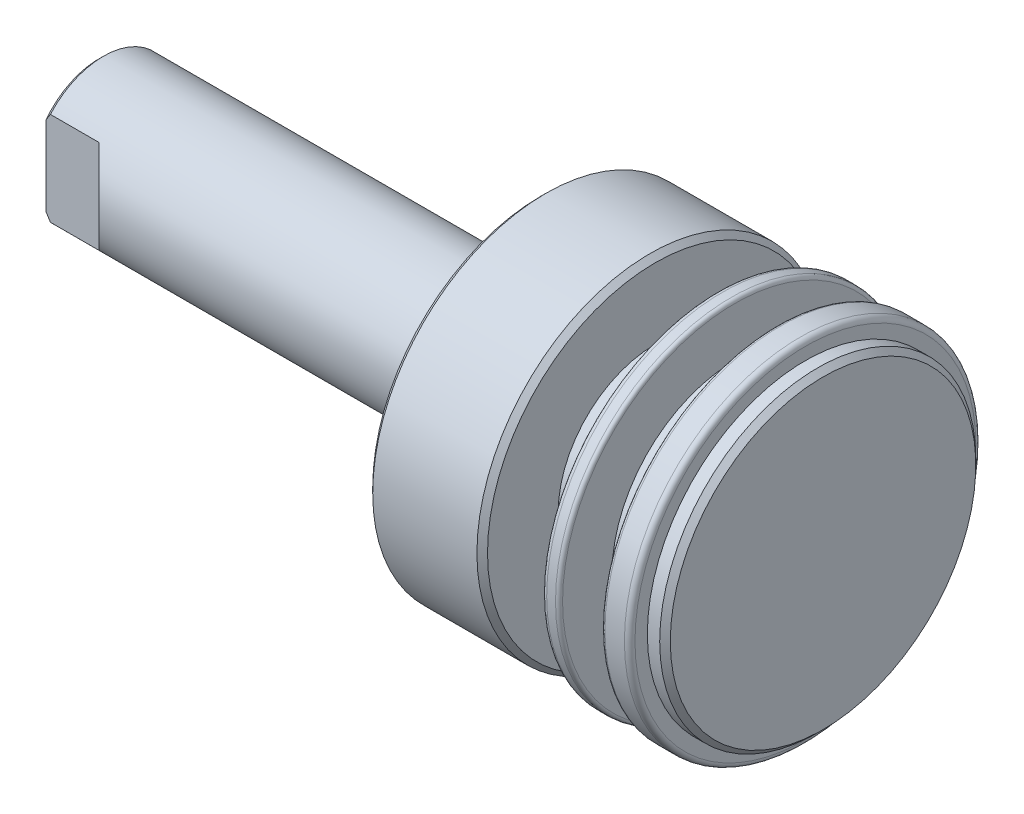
ISO-10303-21;
HEADER;
FILE_DESCRIPTION(('STEP AP214'),'2;1');
FILE_NAME('part.step','',(''),(''),'','','');
FILE_SCHEMA(('AUTOMOTIVE_DESIGN { 1 0 10303 214 1 1 1 1 }'));
ENDSEC;
DATA;
#1=APPLICATION_CONTEXT('core data for automotive mechanical design processes');
#2=APPLICATION_PROTOCOL_DEFINITION('international standard','automotive_design',2000,#1);
#3=PRODUCT_CONTEXT('',#1,'mechanical');
#4=PRODUCT('Part','Part','',(#3));
#5=PRODUCT_RELATED_PRODUCT_CATEGORY('part','',(#4));
#6=PRODUCT_DEFINITION_FORMATION('','',#4);
#7=PRODUCT_DEFINITION_CONTEXT('part definition',#1,'design');
#8=PRODUCT_DEFINITION('design','',#6,#7);
#9=PRODUCT_DEFINITION_SHAPE('','',#8);
#10=(LENGTH_UNIT() NAMED_UNIT(*) SI_UNIT(.MILLI.,.METRE.));
#11=(NAMED_UNIT(*) PLANE_ANGLE_UNIT() SI_UNIT($,.RADIAN.));
#12=(NAMED_UNIT(*) SI_UNIT($,.STERADIAN.) SOLID_ANGLE_UNIT());
#13=UNCERTAINTY_MEASURE_WITH_UNIT(LENGTH_MEASURE(1.E-05),#10,'distance_accuracy_value','');
#14=(GEOMETRIC_REPRESENTATION_CONTEXT(3) GLOBAL_UNCERTAINTY_ASSIGNED_CONTEXT((#13)) GLOBAL_UNIT_ASSIGNED_CONTEXT((#10,
#11,#12)) REPRESENTATION_CONTEXT('',''));
#15=CARTESIAN_POINT('',(0.,0.,0.));
#16=DIRECTION('',(0.,0.,1.));
#17=DIRECTION('',(1.,0.,0.));
#18=AXIS2_PLACEMENT_3D('',#15,#16,#17);
#19=CARTESIAN_POINT('',(35.5,8.65,0.));
#20=DIRECTION('',(-1.,0.,0.));
#21=DIRECTION('',(0.,0.,1.));
#22=AXIS2_PLACEMENT_3D('',#19,#20,#21);
#23=PLANE('',#22);
#24=CARTESIAN_POINT('',(35.5,0.,0.));
#25=DIRECTION('',(-1.,0.,0.));
#26=DIRECTION('',(0.,0.,1.));
#27=AXIS2_PLACEMENT_3D('',#24,#25,#26);
#28=CIRCLE('',#27,8.65);
#29=CARTESIAN_POINT('',(35.5,0.,8.65));
#30=VERTEX_POINT('',#29);
#31=EDGE_CURVE('E294',#30,#30,#28,.T.);
#32=ORIENTED_EDGE('',*,*,#31,.F.);
#33=EDGE_LOOP('',(#32));
#34=FACE_BOUND('',#33,.T.);
#35=ADVANCED_FACE('F17',(#34),#23,.F.);
#36=CARTESIAN_POINT('',(35.2,0.,0.));
#37=DIRECTION('',(-1.,0.,0.));
#38=DIRECTION('',(0.,0.,1.));
#39=AXIS2_PLACEMENT_3D('',#36,#37,#38);
#40=CONICAL_SURFACE('',#39,8.95000000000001,0.785398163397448);
#41=CARTESIAN_POINT('',(35.2,0.,0.));
#42=DIRECTION('',(-1.,0.,0.));
#43=DIRECTION('',(0.,0.,1.));
#44=AXIS2_PLACEMENT_3D('',#41,#42,#43);
#45=CIRCLE('',#44,8.95);
#46=CARTESIAN_POINT('',(35.2,0.,8.95));
#47=VERTEX_POINT('',#46);
#48=EDGE_CURVE('E286',#47,#47,#45,.T.);
#49=ORIENTED_EDGE('',*,*,#48,.F.);
#50=EDGE_LOOP('',(#49));
#51=FACE_BOUND('',#50,.T.);
#52=ORIENTED_EDGE('',*,*,#31,.T.);
#53=EDGE_LOOP('',(#52));
#54=FACE_BOUND('',#53,.T.);
#55=ADVANCED_FACE('F708',(#51,#54),#40,.T.);
#56=CARTESIAN_POINT('',(35.5,0.,0.));
#57=DIRECTION('',(-1.,0.,0.));
#58=DIRECTION('',(0.,0.,1.));
#59=AXIS2_PLACEMENT_3D('',#56,#57,#58);
#60=CYLINDRICAL_SURFACE('',#59,8.95);
#61=CARTESIAN_POINT('',(34.5,0.,0.));
#62=DIRECTION('',(-1.,0.,0.));
#63=DIRECTION('',(0.,0.,1.));
#64=AXIS2_PLACEMENT_3D('',#61,#62,#63);
#65=CIRCLE('',#64,8.95);
#66=CARTESIAN_POINT('',(34.5,0.,8.95));
#67=VERTEX_POINT('',#66);
#68=EDGE_CURVE('E293',#67,#67,#65,.F.);
#69=ORIENTED_EDGE('',*,*,#68,.T.);
#70=EDGE_LOOP('',(#69));
#71=FACE_BOUND('',#70,.T.);
#72=ORIENTED_EDGE('',*,*,#48,.T.);
#73=EDGE_LOOP('',(#72));
#74=FACE_BOUND('',#73,.T.);
#75=ADVANCED_FACE('F700',(#71,#74),#60,.T.);
#76=CARTESIAN_POINT('',(34.5,9.65,0.));
#77=DIRECTION('',(-1.,0.,0.));
#78=DIRECTION('',(0.,0.,1.));
#79=AXIS2_PLACEMENT_3D('',#76,#77,#78);
#80=PLANE('',#79);
#81=ORIENTED_EDGE('',*,*,#68,.F.);
#82=EDGE_LOOP('',(#81));
#83=FACE_BOUND('',#82,.T.);
#84=CARTESIAN_POINT('',(34.5,0.,0.));
#85=DIRECTION('',(-1.,0.,0.));
#86=DIRECTION('',(0.,0.,-1.));
#87=AXIS2_PLACEMENT_3D('',#84,#85,#86);
#88=CIRCLE('',#87,9.65);
#89=CARTESIAN_POINT('',(34.5,0.,-9.65));
#90=VERTEX_POINT('',#89);
#91=CARTESIAN_POINT('',(34.5,0.,9.65));
#92=VERTEX_POINT('',#91);
#93=EDGE_CURVE('E429',#90,#92,#88,.T.);
#94=ORIENTED_EDGE('',*,*,#93,.F.);
#95=CARTESIAN_POINT('',(34.5,0.,0.));
#96=DIRECTION('',(-1.,0.,0.));
#97=DIRECTION('',(0.,0.,1.));
#98=AXIS2_PLACEMENT_3D('',#95,#96,#97);
#99=CIRCLE('',#98,9.65);
#100=EDGE_CURVE('E265',#92,#90,#99,.T.);
#101=ORIENTED_EDGE('',*,*,#100,.F.);
#102=EDGE_LOOP('',(#94,#101));
#103=FACE_BOUND('',#102,.T.);
#104=ADVANCED_FACE('F274',(#83,#103),#80,.F.);
#105=CARTESIAN_POINT('',(34.2,0.,0.));
#106=DIRECTION('',(-1.,0.,0.));
#107=DIRECTION('',(0.,0.,1.));
#108=AXIS2_PLACEMENT_3D('',#105,#106,#107);
#109=TOROIDAL_SURFACE('',#108,9.65,0.300000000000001);
#110=CARTESIAN_POINT('',(34.2,0.,0.));
#111=DIRECTION('',(-1.,0.,0.));
#112=DIRECTION('',(0.,0.,1.));
#113=AXIS2_PLACEMENT_3D('',#110,#111,#112);
#114=CIRCLE('',#113,9.95);
#115=CARTESIAN_POINT('',(34.2,0.,9.95));
#116=VERTEX_POINT('',#115);
#117=EDGE_CURVE('E262',#116,#116,#114,.T.);
#118=ORIENTED_EDGE('',*,*,#117,.F.);
#119=EDGE_LOOP('',(#118));
#120=FACE_BOUND('',#119,.T.);
#121=ORIENTED_EDGE('',*,*,#100,.T.);
#122=ORIENTED_EDGE('',*,*,#93,.T.);
#123=EDGE_LOOP('',(#121,#122));
#124=FACE_BOUND('',#123,.T.);
#125=ADVANCED_FACE('F270',(#120,#124),#109,.T.);
#126=CARTESIAN_POINT('',(35.5,0.,0.));
#127=DIRECTION('',(-1.,0.,0.));
#128=DIRECTION('',(0.,0.,1.));
#129=AXIS2_PLACEMENT_3D('',#126,#127,#128);
#130=CYLINDRICAL_SURFACE('',#129,9.95);
#131=CARTESIAN_POINT('',(33.1,0.,0.));
#132=DIRECTION('',(-1.,0.,0.));
#133=DIRECTION('',(0.,0.,1.));
#134=AXIS2_PLACEMENT_3D('',#131,#132,#133);
#135=CIRCLE('',#134,9.95);
#136=CARTESIAN_POINT('',(33.1,0.,9.95));
#137=VERTEX_POINT('',#136);
#138=EDGE_CURVE('E254',#137,#137,#135,.T.);
#139=ORIENTED_EDGE('',*,*,#138,.F.);
#140=EDGE_LOOP('',(#139));
#141=FACE_BOUND('',#140,.T.);
#142=ORIENTED_EDGE('',*,*,#117,.T.);
#143=EDGE_LOOP('',(#142));
#144=FACE_BOUND('',#143,.T.);
#145=ADVANCED_FACE('F239',(#141,#144),#130,.T.);
#146=CARTESIAN_POINT('',(33.1,0.,0.));
#147=DIRECTION('',(-1.,0.,0.));
#148=DIRECTION('',(0.,0.,1.));
#149=AXIS2_PLACEMENT_3D('',#146,#147,#148);
#150=TOROIDAL_SURFACE('',#149,9.75,0.2);
#151=CARTESIAN_POINT('',(32.9,0.,0.));
#152=DIRECTION('',(1.,0.,0.));
#153=DIRECTION('',(0.,0.,1.));
#154=AXIS2_PLACEMENT_3D('',#151,#152,#153);
#155=CIRCLE('',#154,9.75);
#156=CARTESIAN_POINT('',(32.9,0.,9.75));
#157=VERTEX_POINT('',#156);
#158=CARTESIAN_POINT('',(32.9,0.,-9.75));
#159=VERTEX_POINT('',#158);
#160=EDGE_CURVE('E221',#157,#159,#155,.T.);
#161=ORIENTED_EDGE('',*,*,#160,.T.);
#162=CARTESIAN_POINT('',(32.9,0.,0.));
#163=DIRECTION('',(1.,0.,0.));
#164=DIRECTION('',(0.,0.,-1.));
#165=AXIS2_PLACEMENT_3D('',#162,#163,#164);
#166=CIRCLE('',#165,9.75);
#167=EDGE_CURVE('E250',#159,#157,#166,.T.);
#168=ORIENTED_EDGE('',*,*,#167,.T.);
#169=EDGE_LOOP('',(#161,#168));
#170=FACE_BOUND('',#169,.T.);
#171=ORIENTED_EDGE('',*,*,#138,.T.);
#172=EDGE_LOOP('',(#171));
#173=FACE_BOUND('',#172,.T.);
#174=ADVANCED_FACE('F227',(#170,#173),#150,.T.);
#175=CARTESIAN_POINT('',(32.9,6.95,0.));
#176=DIRECTION('',(1.,0.,0.));
#177=DIRECTION('',(0.,0.,-1.));
#178=AXIS2_PLACEMENT_3D('',#175,#176,#177);
#179=PLANE('',#178);
#180=ORIENTED_EDGE('',*,*,#160,.F.);
#181=ORIENTED_EDGE('',*,*,#167,.F.);
#182=EDGE_LOOP('',(#180,#181));
#183=FACE_BOUND('',#182,.T.);
#184=CARTESIAN_POINT('',(32.9,0.,0.));
#185=DIRECTION('',(-1.,0.,0.));
#186=DIRECTION('',(0.,0.,1.));
#187=AXIS2_PLACEMENT_3D('',#184,#185,#186);
#188=CIRCLE('',#187,6.95);
#189=CARTESIAN_POINT('',(32.9,0.,6.95));
#190=VERTEX_POINT('',#189);
#191=EDGE_CURVE('E437',#190,#190,#188,.T.);
#192=ORIENTED_EDGE('',*,*,#191,.F.);
#193=EDGE_LOOP('',(#192));
#194=FACE_BOUND('',#193,.T.);
#195=ADVANCED_FACE('F238',(#183,#194),#179,.F.);
#196=CARTESIAN_POINT('',(35.5,0.,0.));
#197=DIRECTION('',(-1.,0.,0.));
#198=DIRECTION('',(0.,0.,1.));
#199=AXIS2_PLACEMENT_3D('',#196,#197,#198);
#200=CYLINDRICAL_SURFACE('',#199,6.95);
#201=CARTESIAN_POINT('',(30.5,0.,0.));
#202=DIRECTION('',(-1.,0.,0.));
#203=DIRECTION('',(0.,0.,1.));
#204=AXIS2_PLACEMENT_3D('',#201,#202,#203);
#205=CIRCLE('',#204,6.95);
#206=CARTESIAN_POINT('',(30.5,0.,6.95));
#207=VERTEX_POINT('',#206);
#208=EDGE_CURVE('E459',#207,#207,#205,.F.);
#209=ORIENTED_EDGE('',*,*,#208,.T.);
#210=EDGE_LOOP('',(#209));
#211=FACE_BOUND('',#210,.T.);
#212=ORIENTED_EDGE('',*,*,#191,.T.);
#213=EDGE_LOOP('',(#212));
#214=FACE_BOUND('',#213,.T.);
#215=ADVANCED_FACE('F467',(#211,#214),#200,.T.);
#216=CARTESIAN_POINT('',(30.5,9.75,0.));
#217=DIRECTION('',(-1.,0.,0.));
#218=DIRECTION('',(0.,0.,1.));
#219=AXIS2_PLACEMENT_3D('',#216,#217,#218);
#220=PLANE('',#219);
#221=ORIENTED_EDGE('',*,*,#208,.F.);
#222=EDGE_LOOP('',(#221));
#223=FACE_BOUND('',#222,.T.);
#224=CARTESIAN_POINT('',(30.5,0.,0.));
#225=DIRECTION('',(-1.,0.,0.));
#226=DIRECTION('',(0.,0.,-1.));
#227=AXIS2_PLACEMENT_3D('',#224,#225,#226);
#228=CIRCLE('',#227,9.75);
#229=CARTESIAN_POINT('',(30.5,0.,-9.75));
#230=VERTEX_POINT('',#229);
#231=CARTESIAN_POINT('',(30.5,0.,9.75));
#232=VERTEX_POINT('',#231);
#233=EDGE_CURVE('E461',#230,#232,#228,.T.);
#234=ORIENTED_EDGE('',*,*,#233,.F.);
#235=CARTESIAN_POINT('',(30.5,0.,0.));
#236=DIRECTION('',(-1.,0.,0.));
#237=DIRECTION('',(0.,0.,1.));
#238=AXIS2_PLACEMENT_3D('',#235,#236,#237);
#239=CIRCLE('',#238,9.75);
#240=EDGE_CURVE('E182',#232,#230,#239,.T.);
#241=ORIENTED_EDGE('',*,*,#240,.F.);
#242=EDGE_LOOP('',(#234,#241));
#243=FACE_BOUND('',#242,.T.);
#244=ADVANCED_FACE('F193',(#223,#243),#220,.F.);
#245=CARTESIAN_POINT('',(30.3,0.,0.));
#246=DIRECTION('',(-1.,0.,0.));
#247=DIRECTION('',(0.,0.,1.));
#248=AXIS2_PLACEMENT_3D('',#245,#246,#247);
#249=TOROIDAL_SURFACE('',#248,9.75,0.199999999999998);
#250=CARTESIAN_POINT('',(30.3,0.,0.));
#251=DIRECTION('',(-1.,0.,0.));
#252=DIRECTION('',(0.,0.,1.));
#253=AXIS2_PLACEMENT_3D('',#250,#251,#252);
#254=CIRCLE('',#253,9.95);
#255=CARTESIAN_POINT('',(30.3,0.,9.95));
#256=VERTEX_POINT('',#255);
#257=EDGE_CURVE('E179',#256,#256,#254,.T.);
#258=ORIENTED_EDGE('',*,*,#257,.F.);
#259=EDGE_LOOP('',(#258));
#260=FACE_BOUND('',#259,.T.);
#261=ORIENTED_EDGE('',*,*,#240,.T.);
#262=ORIENTED_EDGE('',*,*,#233,.T.);
#263=EDGE_LOOP('',(#261,#262));
#264=FACE_BOUND('',#263,.T.);
#265=ADVANCED_FACE('F188',(#260,#264),#249,.T.);
#266=CARTESIAN_POINT('',(35.5,0.,0.));
#267=DIRECTION('',(-1.,0.,0.));
#268=DIRECTION('',(0.,0.,1.));
#269=AXIS2_PLACEMENT_3D('',#266,#267,#268);
#270=CYLINDRICAL_SURFACE('',#269,9.95);
#271=CARTESIAN_POINT('',(29.8,0.,0.));
#272=DIRECTION('',(-1.,0.,0.));
#273=DIRECTION('',(0.,0.,1.));
#274=AXIS2_PLACEMENT_3D('',#271,#272,#273);
#275=CIRCLE('',#274,9.95);
#276=CARTESIAN_POINT('',(29.8,0.,9.95));
#277=VERTEX_POINT('',#276);
#278=EDGE_CURVE('E171',#277,#277,#275,.T.);
#279=ORIENTED_EDGE('',*,*,#278,.F.);
#280=EDGE_LOOP('',(#279));
#281=FACE_BOUND('',#280,.T.);
#282=ORIENTED_EDGE('',*,*,#257,.T.);
#283=EDGE_LOOP('',(#282));
#284=FACE_BOUND('',#283,.T.);
#285=ADVANCED_FACE('F192',(#281,#284),#270,.T.);
#286=CARTESIAN_POINT('',(29.8,0.,0.));
#287=DIRECTION('',(-1.,0.,0.));
#288=DIRECTION('',(0.,0.,1.));
#289=AXIS2_PLACEMENT_3D('',#286,#287,#288);
#290=TOROIDAL_SURFACE('',#289,9.65,0.299999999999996);
#291=CARTESIAN_POINT('',(29.5,0.,0.));
#292=DIRECTION('',(1.,0.,0.));
#293=DIRECTION('',(0.,0.,1.));
#294=AXIS2_PLACEMENT_3D('',#291,#292,#293);
#295=CIRCLE('',#294,9.65);
#296=CARTESIAN_POINT('',(29.5,0.,9.65));
#297=VERTEX_POINT('',#296);
#298=CARTESIAN_POINT('',(29.5,0.,-9.65));
#299=VERTEX_POINT('',#298);
#300=EDGE_CURVE('E132',#297,#299,#295,.T.);
#301=ORIENTED_EDGE('',*,*,#300,.T.);
#302=CARTESIAN_POINT('',(29.5,0.,0.));
#303=DIRECTION('',(1.,0.,0.));
#304=DIRECTION('',(0.,0.,-1.));
#305=AXIS2_PLACEMENT_3D('',#302,#303,#304);
#306=CIRCLE('',#305,9.65);
#307=EDGE_CURVE('E167',#299,#297,#306,.T.);
#308=ORIENTED_EDGE('',*,*,#307,.T.);
#309=EDGE_LOOP('',(#301,#308));
#310=FACE_BOUND('',#309,.T.);
#311=ORIENTED_EDGE('',*,*,#278,.T.);
#312=EDGE_LOOP('',(#311));
#313=FACE_BOUND('',#312,.T.);
#314=ADVANCED_FACE('F149',(#310,#313),#290,.T.);
#315=CARTESIAN_POINT('',(29.5,5.5,0.));
#316=DIRECTION('',(1.,0.,0.));
#317=DIRECTION('',(0.,0.,-1.));
#318=AXIS2_PLACEMENT_3D('',#315,#316,#317);
#319=PLANE('',#318);
#320=ORIENTED_EDGE('',*,*,#300,.F.);
#321=ORIENTED_EDGE('',*,*,#307,.F.);
#322=EDGE_LOOP('',(#320,#321));
#323=FACE_BOUND('',#322,.T.);
#324=CARTESIAN_POINT('',(29.5,0.,0.));
#325=DIRECTION('',(-1.,0.,0.));
#326=DIRECTION('',(0.,0.,1.));
#327=AXIS2_PLACEMENT_3D('',#324,#325,#326);
#328=CIRCLE('',#327,5.5);
#329=CARTESIAN_POINT('',(29.5,0.,5.5));
#330=VERTEX_POINT('',#329);
#331=EDGE_CURVE('E450',#330,#330,#328,.T.);
#332=ORIENTED_EDGE('',*,*,#331,.F.);
#333=EDGE_LOOP('',(#332));
#334=FACE_BOUND('',#333,.T.);
#335=ADVANCED_FACE('F138',(#323,#334),#319,.F.);
#336=CARTESIAN_POINT('',(35.5,0.,0.));
#337=DIRECTION('',(-1.,0.,0.));
#338=DIRECTION('',(0.,0.,1.));
#339=AXIS2_PLACEMENT_3D('',#336,#337,#338);
#340=CYLINDRICAL_SURFACE('',#339,5.5);
#341=CARTESIAN_POINT('',(26.,0.,0.));
#342=DIRECTION('',(-1.,0.,0.));
#343=DIRECTION('',(0.,0.,1.));
#344=AXIS2_PLACEMENT_3D('',#341,#342,#343);
#345=CIRCLE('',#344,5.5);
#346=CARTESIAN_POINT('',(26.,0.,5.5));
#347=VERTEX_POINT('',#346);
#348=EDGE_CURVE('E452',#347,#347,#345,.F.);
#349=ORIENTED_EDGE('',*,*,#348,.T.);
#350=EDGE_LOOP('',(#349));
#351=FACE_BOUND('',#350,.T.);
#352=ORIENTED_EDGE('',*,*,#331,.T.);
#353=EDGE_LOOP('',(#352));
#354=FACE_BOUND('',#353,.T.);
#355=ADVANCED_FACE('F148',(#351,#354),#340,.T.);
#356=CARTESIAN_POINT('',(26.,9.5,0.));
#357=DIRECTION('',(-1.,0.,0.));
#358=DIRECTION('',(0.,0.,1.));
#359=AXIS2_PLACEMENT_3D('',#356,#357,#358);
#360=PLANE('',#359);
#361=ORIENTED_EDGE('',*,*,#348,.F.);
#362=EDGE_LOOP('',(#361));
#363=FACE_BOUND('',#362,.T.);
#364=CARTESIAN_POINT('',(26.,0.,0.));
#365=DIRECTION('',(-1.,0.,0.));
#366=DIRECTION('',(0.,-1.,0.));
#367=AXIS2_PLACEMENT_3D('',#364,#365,#366);
#368=CIRCLE('',#367,9.5);
#369=CARTESIAN_POINT('',(26.,-9.5,0.));
#370=VERTEX_POINT('',#369);
#371=EDGE_CURVE('E125',#370,#370,#368,.T.);
#372=ORIENTED_EDGE('',*,*,#371,.F.);
#373=EDGE_LOOP('',(#372));
#374=FACE_BOUND('',#373,.T.);
#375=ADVANCED_FACE('F363',(#363,#374),#360,.F.);
#376=CARTESIAN_POINT('',(4.10000000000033,0.,0.));
#377=DIRECTION('',(-1.,0.,0.));
#378=DIRECTION('',(0.,0.,1.));
#379=AXIS2_PLACEMENT_3D('',#376,#377,#378);
#380=CONICAL_SURFACE('',#379,1.62099999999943,1.04719755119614);
#381=CARTESIAN_POINT('',(5.03588478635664,0.,4.44089209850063E-13));
#382=VERTEX_POINT('',#381);
#383=VERTEX_LOOP('',#382);
#384=FACE_BOUND('',#383,.T.);
#385=CARTESIAN_POINT('',(4.1,0.,0.));
#386=DIRECTION('',(-1.,0.,0.));
#387=DIRECTION('',(0.,0.,1.));
#388=AXIS2_PLACEMENT_3D('',#385,#386,#387);
#389=CIRCLE('',#388,1.621);
#390=CARTESIAN_POINT('',(4.1,0.,1.621));
#391=VERTEX_POINT('',#390);
#392=EDGE_CURVE('E122',#391,#391,#389,.T.);
#393=ORIENTED_EDGE('',*,*,#392,.T.);
#394=EDGE_LOOP('',(#393));
#395=FACE_BOUND('',#394,.T.);
#396=ADVANCED_FACE('F360',(#384,#395),#380,.F.);
#397=CARTESIAN_POINT('',(25.7,0.,0.));
#398=DIRECTION('',(-1.,0.,0.));
#399=DIRECTION('',(0.,-1.,0.));
#400=AXIS2_PLACEMENT_3D('',#397,#398,#399);
#401=CONICAL_SURFACE('',#400,9.8,0.785398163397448);
#402=ORIENTED_EDGE('',*,*,#371,.T.);
#403=EDGE_LOOP('',(#402));
#404=FACE_BOUND('',#403,.T.);
#405=CARTESIAN_POINT('',(25.7,0.,0.));
#406=DIRECTION('',(-1.,0.,0.));
#407=DIRECTION('',(0.,0.,1.));
#408=AXIS2_PLACEMENT_3D('',#405,#406,#407);
#409=CIRCLE('',#408,9.8);
#410=CARTESIAN_POINT('',(25.7,0.,9.8));
#411=VERTEX_POINT('',#410);
#412=EDGE_CURVE('E119',#411,#411,#409,.T.);
#413=ORIENTED_EDGE('',*,*,#412,.F.);
#414=EDGE_LOOP('',(#413));
#415=FACE_BOUND('',#414,.T.);
#416=ADVANCED_FACE('F356',(#404,#415),#401,.T.);
#417=CARTESIAN_POINT('',(5.03588478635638,0.,0.));
#418=DIRECTION('',(-1.,0.,0.));
#419=DIRECTION('',(0.,0.,1.));
#420=AXIS2_PLACEMENT_3D('',#417,#418,#419);
#421=CYLINDRICAL_SURFACE('',#420,1.621);
#422=ORIENTED_EDGE('',*,*,#392,.F.);
#423=EDGE_LOOP('',(#422));
#424=FACE_BOUND('',#423,.T.);
#425=CARTESIAN_POINT('',(-5.12099999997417,0.,0.));
#426=DIRECTION('',(-1.,0.,0.));
#427=DIRECTION('',(0.,0.,1.));
#428=AXIS2_PLACEMENT_3D('',#425,#426,#427);
#429=CIRCLE('',#428,1.62100000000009);
#430=CARTESIAN_POINT('',(-5.12099999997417,0.,1.62100000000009));
#431=VERTEX_POINT('',#430);
#432=EDGE_CURVE('E116',#431,#431,#429,.T.);
#433=ORIENTED_EDGE('',*,*,#432,.T.);
#434=EDGE_LOOP('',(#433));
#435=FACE_BOUND('',#434,.T.);
#436=ADVANCED_FACE('F352',(#424,#435),#421,.F.);
#437=CARTESIAN_POINT('',(35.5,0.,0.));
#438=DIRECTION('',(-1.,0.,0.));
#439=DIRECTION('',(0.,0.,1.));
#440=AXIS2_PLACEMENT_3D('',#437,#438,#439);
#441=CYLINDRICAL_SURFACE('',#440,9.8);
#442=ORIENTED_EDGE('',*,*,#412,.T.);
#443=EDGE_LOOP('',(#442));
#444=FACE_BOUND('',#443,.T.);
#445=CARTESIAN_POINT('',(19.8,0.,0.));
#446=DIRECTION('',(1.,0.,0.));
#447=DIRECTION('',(0.,0.,-1.));
#448=AXIS2_PLACEMENT_3D('',#445,#446,#447);
#449=CIRCLE('',#448,9.8);
#450=CARTESIAN_POINT('',(19.8,0.,-9.8));
#451=VERTEX_POINT('',#450);
#452=EDGE_CURVE('E113',#451,#451,#449,.F.);
#453=ORIENTED_EDGE('',*,*,#452,.F.);
#454=EDGE_LOOP('',(#453));
#455=FACE_BOUND('',#454,.T.);
#456=ADVANCED_FACE('F348',(#444,#455),#441,.T.);
#457=CARTESIAN_POINT('',(-5.50000000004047,0.,0.));
#458=DIRECTION('',(-1.,0.,0.));
#459=DIRECTION('',(0.,0.,1.));
#460=AXIS2_PLACEMENT_3D('',#457,#458,#459);
#461=CONICAL_SURFACE('',#460,2.00000000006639,0.785398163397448);
#462=ORIENTED_EDGE('',*,*,#432,.F.);
#463=EDGE_LOOP('',(#462));
#464=FACE_BOUND('',#463,.T.);
#465=CARTESIAN_POINT('',(-5.49999999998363,0.,0.));
#466=DIRECTION('',(-1.,0.,0.));
#467=DIRECTION('',(0.,0.,1.));
#468=AXIS2_PLACEMENT_3D('',#465,#466,#467);
#469=CIRCLE('',#468,2.00000000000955);
#470=CARTESIAN_POINT('',(-5.49999999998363,0.,2.00000000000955));
#471=VERTEX_POINT('',#470);
#472=EDGE_CURVE('E83',#471,#471,#469,.T.);
#473=ORIENTED_EDGE('',*,*,#472,.T.);
#474=EDGE_LOOP('',(#473));
#475=FACE_BOUND('',#474,.T.);
#476=ADVANCED_FACE('F344',(#464,#475),#461,.F.);
#477=CARTESIAN_POINT('',(19.8,0.,0.));
#478=DIRECTION('',(1.,0.,0.));
#479=DIRECTION('',(0.,1.,0.));
#480=AXIS2_PLACEMENT_3D('',#477,#478,#479);
#481=CONICAL_SURFACE('',#480,9.8,0.785398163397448);
#482=CARTESIAN_POINT('',(19.5,0.,0.));
#483=DIRECTION('',(1.,0.,0.));
#484=DIRECTION('',(0.,1.,0.));
#485=AXIS2_PLACEMENT_3D('',#482,#483,#484);
#486=CIRCLE('',#485,9.5);
#487=CARTESIAN_POINT('',(19.5,9.5,0.));
#488=VERTEX_POINT('',#487);
#489=EDGE_CURVE('E82',#488,#488,#486,.T.);
#490=ORIENTED_EDGE('',*,*,#489,.T.);
#491=EDGE_LOOP('',(#490));
#492=FACE_BOUND('',#491,.T.);
#493=ORIENTED_EDGE('',*,*,#452,.T.);
#494=EDGE_LOOP('',(#493));
#495=FACE_BOUND('',#494,.T.);
#496=ADVANCED_FACE('F340',(#492,#495),#481,.T.);
#497=CARTESIAN_POINT('',(-5.5,0.,0.));
#498=DIRECTION('',(1.,0.,0.));
#499=DIRECTION('',(0.,0.,-1.));
#500=AXIS2_PLACEMENT_3D('',#497,#498,#499);
#501=PLANE('',#500);
#502=ORIENTED_EDGE('',*,*,#472,.F.);
#503=EDGE_LOOP('',(#502));
#504=FACE_BOUND('',#503,.T.);
#505=DIRECTION('',(0.,1.,0.));
#506=VECTOR('',#505,1.);
#507=CARTESIAN_POINT('',(-5.5,-6.,-3.));
#508=LINE('',#507,#506);
#509=CARTESIAN_POINT('',(-5.49999999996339,2.24999999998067,-3.));
#510=VERTEX_POINT('',#509);
#511=CARTESIAN_POINT('',(-5.49999999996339,-2.24999999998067,-3.));
#512=VERTEX_POINT('',#511);
#513=EDGE_CURVE('E79',#510,#512,#508,.F.);
#514=ORIENTED_EDGE('',*,*,#513,.T.);
#515=CARTESIAN_POINT('',(-5.49999999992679,0.,0.));
#516=DIRECTION('',(1.,0.,0.));
#517=DIRECTION('',(0.,0.,-1.));
#518=AXIS2_PLACEMENT_3D('',#515,#516,#517);
#519=CIRCLE('',#518,3.75000000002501);
#520=CARTESIAN_POINT('',(-5.49999999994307,-2.25000000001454,3.));
#521=VERTEX_POINT('',#520);
#522=EDGE_CURVE('E72',#521,#512,#519,.T.);
#523=ORIENTED_EDGE('',*,*,#522,.F.);
#524=DIRECTION('',(0.,1.,0.));
#525=VECTOR('',#524,1.);
#526=CARTESIAN_POINT('',(-5.5,-6.,3.));
#527=LINE('',#526,#525);
#528=CARTESIAN_POINT('',(-5.49999999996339,2.24999999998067,3.));
#529=VERTEX_POINT('',#528);
#530=EDGE_CURVE('E77',#521,#529,#527,.T.);
#531=ORIENTED_EDGE('',*,*,#530,.T.);
#532=CARTESIAN_POINT('',(-5.49999999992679,0.,0.));
#533=DIRECTION('',(1.,0.,0.));
#534=DIRECTION('',(0.,0.,-1.));
#535=AXIS2_PLACEMENT_3D('',#532,#533,#534);
#536=CIRCLE('',#535,3.75000000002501);
#537=EDGE_CURVE('E91',#510,#529,#536,.T.);
#538=ORIENTED_EDGE('',*,*,#537,.F.);
#539=EDGE_LOOP('',(#514,#523,#531,#538));
#540=FACE_BOUND('',#539,.T.);
#541=ADVANCED_FACE('F74',(#504,#540),#501,.F.);
#542=CARTESIAN_POINT('',(-5.24999999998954,0.,0.));
#543=DIRECTION('',(1.,0.,0.));
#544=DIRECTION('',(0.,0.,-1.));
#545=AXIS2_PLACEMENT_3D('',#542,#543,#544);
#546=CONICAL_SURFACE('',#545,3.99999999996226,0.785398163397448);
#547=CARTESIAN_POINT('',(-5.25,0.,0.));
#548=DIRECTION('',(-1.,0.,0.));
#549=DIRECTION('',(0.,0.,1.));
#550=AXIS2_PLACEMENT_3D('',#547,#548,#549);
#551=CIRCLE('',#550,4.);
#552=CARTESIAN_POINT('',(-5.24999999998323,-2.6457513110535,3.));
#553=VERTEX_POINT('',#552);
#554=CARTESIAN_POINT('',(-5.24999999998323,-2.6457513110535,-3.));
#555=VERTEX_POINT('',#554);
#556=EDGE_CURVE('E89',#553,#555,#551,.F.);
#557=ORIENTED_EDGE('',*,*,#556,.F.);
#558=CARTESIAN_POINT('',(-5.24999999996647,-2.64575131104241,3.));
#559=CARTESIAN_POINT('',(-5.2715225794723,-2.61321158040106,3.));
#560=CARTESIAN_POINT('',(-5.29289053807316,-2.58056923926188,3.));
#561=CARTESIAN_POINT('',(-5.33528900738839,-2.51507176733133,3.));
#562=CARTESIAN_POINT('',(-5.35631955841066,-2.48221666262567,3.));
#563=CARTESIAN_POINT('',(-5.39802044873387,-2.41627787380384,3.));
#564=CARTESIAN_POINT('',(-5.41869078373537,-2.38319418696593,3.));
#565=CARTESIAN_POINT('',(-5.45964401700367,-2.31678245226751,3.));
#566=CARTESIAN_POINT('',(-5.47992686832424,-2.28345437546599,3.));
#567=CARTESIAN_POINT('',(-5.49999999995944,-2.24999999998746,3.));
#568=B_SPLINE_CURVE_WITH_KNOTS('',3,(#558,#559,#560,#561,#562,#563,#564,#565,#566,#567),
.UNSPECIFIED.,.F.,.F.,(4,2,2,2,4),(0.,0.117040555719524,0.234067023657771,0.351094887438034,
0.46813684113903),.UNSPECIFIED.);
#569=EDGE_CURVE('E86',#553,#521,#568,.T.);
#570=ORIENTED_EDGE('',*,*,#569,.T.);
#571=ORIENTED_EDGE('',*,*,#522,.T.);
#572=CARTESIAN_POINT('',(-5.49999999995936,-2.2499999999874,-3.));
#573=CARTESIAN_POINT('',(-5.47992686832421,-2.28345437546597,-3.));
#574=CARTESIAN_POINT('',(-5.45964401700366,-2.31678245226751,-3.));
#575=CARTESIAN_POINT('',(-5.41869078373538,-2.38319418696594,-3.));
#576=CARTESIAN_POINT('',(-5.39802044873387,-2.41627787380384,-3.));
#577=CARTESIAN_POINT('',(-5.35631955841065,-2.48221666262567,-3.));
#578=CARTESIAN_POINT('',(-5.33528900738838,-2.51507176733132,-3.));
#579=CARTESIAN_POINT('',(-5.29289053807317,-2.58056923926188,-3.));
#580=CARTESIAN_POINT('',(-5.27152257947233,-2.61321158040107,-3.));
#581=CARTESIAN_POINT('',(-5.24999999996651,-2.64575131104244,-3.));
#582=B_SPLINE_CURVE_WITH_KNOTS('',3,(#572,#573,#574,#575,#576,#577,#578,#579,#580,#581),
.UNSPECIFIED.,.F.,.F.,(4,2,2,2,4),(0.,0.117041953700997,0.234069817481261,0.351096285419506,
0.46813684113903),.UNSPECIFIED.);
#583=EDGE_CURVE('E106',#512,#555,#582,.T.);
#584=ORIENTED_EDGE('',*,*,#583,.T.);
#585=EDGE_LOOP('',(#557,#570,#571,#584));
#586=FACE_BOUND('',#585,.T.);
#587=ADVANCED_FACE('F87',(#586),#546,.T.);
#588=CARTESIAN_POINT('',(19.5,4.,0.));
#589=DIRECTION('',(1.,0.,0.));
#590=DIRECTION('',(0.,0.,-1.));
#591=AXIS2_PLACEMENT_3D('',#588,#589,#590);
#592=PLANE('',#591);
#593=ORIENTED_EDGE('',*,*,#489,.F.);
#594=EDGE_LOOP('',(#593));
#595=FACE_BOUND('',#594,.T.);
#596=CARTESIAN_POINT('',(19.5,0.,0.));
#597=DIRECTION('',(-1.,0.,0.));
#598=DIRECTION('',(0.,0.,1.));
#599=AXIS2_PLACEMENT_3D('',#596,#597,#598);
#600=CIRCLE('',#599,4.);
#601=CARTESIAN_POINT('',(19.5,0.,4.));
#602=VERTEX_POINT('',#601);
#603=EDGE_CURVE('E299',#602,#602,#600,.T.);
#604=ORIENTED_EDGE('',*,*,#603,.F.);
#605=EDGE_LOOP('',(#604));
#606=FACE_BOUND('',#605,.T.);
#607=ADVANCED_FACE('F336',(#595,#606),#592,.F.);
#608=CARTESIAN_POINT('',(-2.5,-6.,-3.));
#609=DIRECTION('',(0.707106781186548,0.,0.707106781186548));
#610=DIRECTION('',(0.707106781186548,0.,-0.707106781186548));
#611=AXIS2_PLACEMENT_3D('',#608,#609,#610);
#612=PLANE('',#611);
#613=CARTESIAN_POINT('',(-5.5,0.,0.));
#614=DIRECTION('',(0.707106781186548,0.,0.707106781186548));
#615=DIRECTION('',(-0.707106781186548,0.,0.707106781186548));
#616=AXIS2_PLACEMENT_3D('',#613,#614,#615);
#617=ELLIPSE('',#616,5.65685424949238,4.);
#618=CARTESIAN_POINT('',(-2.5,-2.64575131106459,-3.));
#619=VERTEX_POINT('',#618);
#620=CARTESIAN_POINT('',(-2.5,2.64575131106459,-3.));
#621=VERTEX_POINT('',#620);
#622=EDGE_CURVE('E296',#619,#621,#617,.T.);
#623=ORIENTED_EDGE('',*,*,#622,.F.);
#624=DIRECTION('',(0.,1.,0.));
#625=VECTOR('',#624,1.);
#626=CARTESIAN_POINT('',(-2.5,-6.,-3.));
#627=LINE('',#626,#625);
#628=EDGE_CURVE('E107',#619,#621,#627,.T.);
#629=ORIENTED_EDGE('',*,*,#628,.T.);
#630=EDGE_LOOP('',(#623,#629));
#631=FACE_BOUND('',#630,.T.);
#632=ADVANCED_FACE('F389',(#631),#612,.F.);
#633=CARTESIAN_POINT('',(-5.5,-6.,-3.));
#634=DIRECTION('',(0.,0.,1.));
#635=DIRECTION('',(1.,0.,0.));
#636=AXIS2_PLACEMENT_3D('',#633,#634,#635);
#637=PLANE('',#636);
#638=ORIENTED_EDGE('',*,*,#628,.F.);
#639=DIRECTION('',(-1.,0.,0.));
#640=VECTOR('',#639,1.);
#641=CARTESIAN_POINT('',(0.,-2.64575131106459,-3.));
#642=LINE('',#641,#640);
#643=EDGE_CURVE('E111',#555,#619,#642,.F.);
#644=ORIENTED_EDGE('',*,*,#643,.F.);
#645=ORIENTED_EDGE('',*,*,#583,.F.);
#646=ORIENTED_EDGE('',*,*,#513,.F.);
#647=CARTESIAN_POINT('',(-5.24999999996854,2.64575131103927,-3.));
#648=CARTESIAN_POINT('',(-5.27152257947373,2.61321158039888,-3.));
#649=CARTESIAN_POINT('',(-5.29289053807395,2.58056923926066,-3.));
#650=CARTESIAN_POINT('',(-5.33528900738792,2.51507176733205,-3.));
#651=CARTESIAN_POINT('',(-5.35631955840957,2.48221666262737,-3.));
#652=CARTESIAN_POINT('',(-5.39802044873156,2.4162778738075,-3.));
#653=CARTESIAN_POINT('',(-5.41869078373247,2.38319418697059,-3.));
#654=CARTESIAN_POINT('',(-5.4596440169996,2.31678245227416,-3.));
#655=CARTESIAN_POINT('',(-5.4799268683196,2.28345437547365,-3.));
#656=CARTESIAN_POINT('',(-5.49999999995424,2.24999999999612,-3.));
#657=B_SPLINE_CURVE_WITH_KNOTS('',3,(#647,#648,#649,#650,#651,#652,#653,#654,#655,#656),
.UNSPECIFIED.,.F.,.F.,(4,2,2,2,4),(0.,0.117040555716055,0.234067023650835,0.351094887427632,
0.468136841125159),.UNSPECIFIED.);
#658=CARTESIAN_POINT('',(-5.24999999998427,2.64575131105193,-3.));
#659=VERTEX_POINT('',#658);
#660=EDGE_CURVE('E109',#659,#510,#657,.T.);
#661=ORIENTED_EDGE('',*,*,#660,.F.);
#662=DIRECTION('',(-1.,0.,0.));
#663=VECTOR('',#662,1.);
#664=CARTESIAN_POINT('',(0.,2.64575131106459,-3.));
#665=LINE('',#664,#663);
#666=EDGE_CURVE('E104',#621,#659,#665,.T.);
#667=ORIENTED_EDGE('',*,*,#666,.F.);
#668=EDGE_LOOP('',(#638,#644,#645,#646,#661,#667));
#669=FACE_BOUND('',#668,.T.);
#670=ADVANCED_FACE('F317',(#669),#637,.F.);
#671=CARTESIAN_POINT('',(-5.24999999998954,0.,0.));
#672=DIRECTION('',(1.,0.,0.));
#673=DIRECTION('',(0.,0.,-1.));
#674=AXIS2_PLACEMENT_3D('',#671,#672,#673);
#675=CONICAL_SURFACE('',#674,3.99999999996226,0.785398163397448);
#676=ORIENTED_EDGE('',*,*,#537,.T.);
#677=CARTESIAN_POINT('',(-5.49999999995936,2.2499999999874,3.));
#678=CARTESIAN_POINT('',(-5.47992686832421,2.28345437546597,3.));
#679=CARTESIAN_POINT('',(-5.45964401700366,2.31678245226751,3.));
#680=CARTESIAN_POINT('',(-5.41869078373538,2.38319418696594,3.));
#681=CARTESIAN_POINT('',(-5.39802044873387,2.41627787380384,3.));
#682=CARTESIAN_POINT('',(-5.35631955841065,2.48221666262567,3.));
#683=CARTESIAN_POINT('',(-5.33528900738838,2.51507176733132,3.));
#684=CARTESIAN_POINT('',(-5.29289053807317,2.58056923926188,3.));
#685=CARTESIAN_POINT('',(-5.27152257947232,2.61321158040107,3.));
#686=CARTESIAN_POINT('',(-5.24999999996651,2.64575131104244,3.));
#687=B_SPLINE_CURVE_WITH_KNOTS('',3,(#677,#678,#679,#680,#681,#682,#683,#684,#685,#686),
.UNSPECIFIED.,.F.,.F.,(4,2,2,2,4),(0.,0.117041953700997,0.234069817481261,0.351096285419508,
0.468136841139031),.UNSPECIFIED.);
#688=CARTESIAN_POINT('',(-5.24999999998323,2.6457513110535,3.));
#689=VERTEX_POINT('',#688);
#690=EDGE_CURVE('E95',#529,#689,#687,.T.);
#691=ORIENTED_EDGE('',*,*,#690,.T.);
#692=CARTESIAN_POINT('',(-5.25,0.,0.));
#693=DIRECTION('',(-1.,0.,0.));
#694=DIRECTION('',(0.,0.,1.));
#695=AXIS2_PLACEMENT_3D('',#692,#693,#694);
#696=CIRCLE('',#695,4.);
#697=EDGE_CURVE('E101',#659,#689,#696,.F.);
#698=ORIENTED_EDGE('',*,*,#697,.F.);
#699=ORIENTED_EDGE('',*,*,#660,.T.);
#700=EDGE_LOOP('',(#676,#691,#698,#699));
#701=FACE_BOUND('',#700,.T.);
#702=ADVANCED_FACE('F313',(#701),#675,.T.);
#703=CARTESIAN_POINT('',(-2.5,-6.,3.));
#704=DIRECTION('',(0.,0.,-1.));
#705=DIRECTION('',(-1.,0.,0.));
#706=AXIS2_PLACEMENT_3D('',#703,#704,#705);
#707=PLANE('',#706);
#708=DIRECTION('',(0.,1.,0.));
#709=VECTOR('',#708,1.);
#710=CARTESIAN_POINT('',(-2.5,-6.,3.));
#711=LINE('',#710,#709);
#712=CARTESIAN_POINT('',(-2.5,-2.64575131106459,3.));
#713=VERTEX_POINT('',#712);
#714=CARTESIAN_POINT('',(-2.5,2.64575131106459,3.));
#715=VERTEX_POINT('',#714);
#716=EDGE_CURVE('E37',#713,#715,#711,.T.);
#717=ORIENTED_EDGE('',*,*,#716,.T.);
#718=DIRECTION('',(-1.,0.,0.));
#719=VECTOR('',#718,1.);
#720=CARTESIAN_POINT('',(0.,2.64575131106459,3.));
#721=LINE('',#720,#719);
#722=EDGE_CURVE('E28',#689,#715,#721,.F.);
#723=ORIENTED_EDGE('',*,*,#722,.F.);
#724=ORIENTED_EDGE('',*,*,#690,.F.);
#725=ORIENTED_EDGE('',*,*,#530,.F.);
#726=ORIENTED_EDGE('',*,*,#569,.F.);
#727=DIRECTION('',(-1.,0.,0.));
#728=VECTOR('',#727,1.);
#729=CARTESIAN_POINT('',(0.,-2.64575131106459,3.));
#730=LINE('',#729,#728);
#731=EDGE_CURVE('E112',#713,#553,#730,.T.);
#732=ORIENTED_EDGE('',*,*,#731,.F.);
#733=EDGE_LOOP('',(#717,#723,#724,#725,#726,#732));
#734=FACE_BOUND('',#733,.T.);
#735=ADVANCED_FACE('F94',(#734),#707,.F.);
#736=CARTESIAN_POINT('',(2.5,-6.,8.));
#737=DIRECTION('',(0.707106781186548,0.,-0.707106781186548));
#738=DIRECTION('',(-0.707106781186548,0.,-0.707106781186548));
#739=AXIS2_PLACEMENT_3D('',#736,#737,#738);
#740=PLANE('',#739);
#741=ORIENTED_EDGE('',*,*,#716,.F.);
#742=CARTESIAN_POINT('',(-5.5,0.,0.));
#743=DIRECTION('',(0.707106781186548,0.,-0.707106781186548));
#744=DIRECTION('',(-0.707106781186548,0.,-0.707106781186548));
#745=AXIS2_PLACEMENT_3D('',#742,#743,#744);
#746=ELLIPSE('',#745,5.65685424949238,4.);
#747=EDGE_CURVE('E11',#715,#713,#746,.T.);
#748=ORIENTED_EDGE('',*,*,#747,.F.);
#749=EDGE_LOOP('',(#741,#748));
#750=FACE_BOUND('',#749,.T.);
#751=ADVANCED_FACE('F376',(#750),#740,.F.);
#752=CARTESIAN_POINT('',(0.,0.,0.));
#753=DIRECTION('',(-1.,0.,0.));
#754=DIRECTION('',(0.,0.,1.));
#755=AXIS2_PLACEMENT_3D('',#752,#753,#754);
#756=CYLINDRICAL_SURFACE('',#755,4.);
#757=ORIENTED_EDGE('',*,*,#643,.T.);
#758=ORIENTED_EDGE('',*,*,#622,.T.);
#759=ORIENTED_EDGE('',*,*,#666,.T.);
#760=ORIENTED_EDGE('',*,*,#697,.T.);
#761=ORIENTED_EDGE('',*,*,#722,.T.);
#762=ORIENTED_EDGE('',*,*,#747,.T.);
#763=ORIENTED_EDGE('',*,*,#731,.T.);
#764=ORIENTED_EDGE('',*,*,#556,.T.);
#765=EDGE_LOOP('',(#757,#758,#759,#760,#761,#762,#763,#764));
#766=FACE_BOUND('',#765,.T.);
#767=ORIENTED_EDGE('',*,*,#603,.T.);
#768=EDGE_LOOP('',(#767));
#769=FACE_BOUND('',#768,.T.);
#770=ADVANCED_FACE('F374',(#766,#769),#756,.T.);
#771=CLOSED_SHELL('',(#35,#55,#75,#104,#125,#145,#174,#195,#215,#244,#265,#285,#314,#335,#355,
#375,#396,#416,#436,#456,#476,#496,#541,#587,#607,#632,#670,#702,#735,#751,#770));
#772=MANIFOLD_SOLID_BREP('B1',#771);
#773=ADVANCED_BREP_SHAPE_REPRESENTATION('',(#18,#772),#14);
#774=SHAPE_DEFINITION_REPRESENTATION(#9,#773);
ENDSEC;
END-ISO-10303-21;
